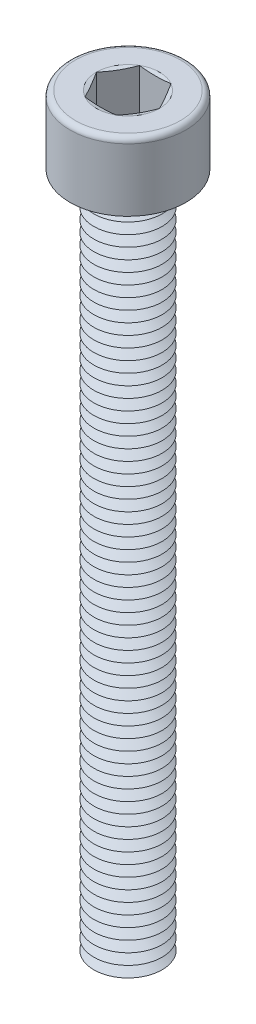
from build123d import *

# Parameters (mm, degrees)
SKETCH1_R       = 2.5
EXTRUDE1_DEPTH  = 50
SKETCH2_R       = 4.25
EXTRUDE2_DEPTH  = 5
EXTRUDE3_DEPTH  = 4
FILLET1_R       = 0.4
LPATTERN1_COUNT = 63
LPATTERN1_PITCH = 0.8


with BuildPart() as part:
    # Sketch1 → Extrude1 (new body)
    with BuildSketch(Plane(origin=(0, 0, 0), x_dir=(1, 0, 0), z_dir=(0, 1, 0))):
        with Locations(Location((0, 0, 0), (0, 0, 270))):
            Circle(SKETCH1_R)
    extrude(amount=EXTRUDE1_DEPTH)

    # Sketch2 → Extrude2 (add)
    with BuildSketch(Plane(origin=(0, 50, 0), x_dir=(1, 0, 0), z_dir=(0, 1, 0))):
        with Locations(Location((0, 0, 0), (0, 0, 270))):
            Circle(SKETCH2_R)
    extrude(amount=EXTRUDE2_DEPTH)

    # Sketch3 → Extrude3 (cut)
    with BuildSketch(Plane(origin=(0, 55, 0), x_dir=(1, 0, 0), z_dir=(0, 1, 0))):
        Polygon((1.154700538, 2), (-1.154700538, 2), (-2.309401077, 0), (-1.154700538, -2), (1.154700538, -2), (2.309401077, 0), align=None)
    extrude(amount=-EXTRUDE3_DEPTH, mode=Mode.SUBTRACT)

    # Fillet1
    fillet1_edges = [part.edges().sort_by_distance(p)[0] for p in [
        (0, 55, -4.25),
    ]]
    fillet(fillet1_edges, radius=FILLET1_R)

    # Sketch4 → Cut-Revolve1 (revolve, cut)
    with BuildSketch(Plane(origin=(0, 0, 0), x_dir=(0, 0, -1), z_dir=(1, 0, 0))):
        Polygon((-2, 51), (0, 51), (0, 49.845299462), align=None)
    revolve(axis=Axis((0, 51, 0), (0, -1, 0)), mode=Mode.SUBTRACT)

    # Sketch5 → Cut-Revolve2 (revolve, cut)
    with BuildSketch(Plane.XY, mode=Mode.PRIVATE) as cut_revolve2_sk:
        Polygon((-2.5, 0.4), (-2.5, -0.4), (-1.807179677, 0), align=None)
    cut_revolve2 = revolve(cut_revolve2_sk.sketch.rotate(Axis((0, 50, 0), (0, -1, 0)), 270), axis=Axis((0, 50, 0), (0, -1, 0)), mode=Mode.SUBTRACT)

    # LPattern1: Cut-Revolve2 ×63
    with Locations(*[(0, i * LPATTERN1_PITCH, 0) for i in range(1, LPATTERN1_COUNT)]):
        add(cut_revolve2, mode=Mode.SUBTRACT)

    # Extrude4 cone 1 section (on through the dimple's axis) → Extrude4 (revolve, cut)
    with BuildSketch(Plane(origin=(0, 55, 0), x_dir=(0, 0, 1), z_dir=(1, 0, 0))):
        Polygon((0, 0), (2.309401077, 0), (0, 0.618802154), align=None)
    revolve(axis=Axis((0, 55, 0), (0, -1, 0)), mode=Mode.SUBTRACT)


solid = part.part
